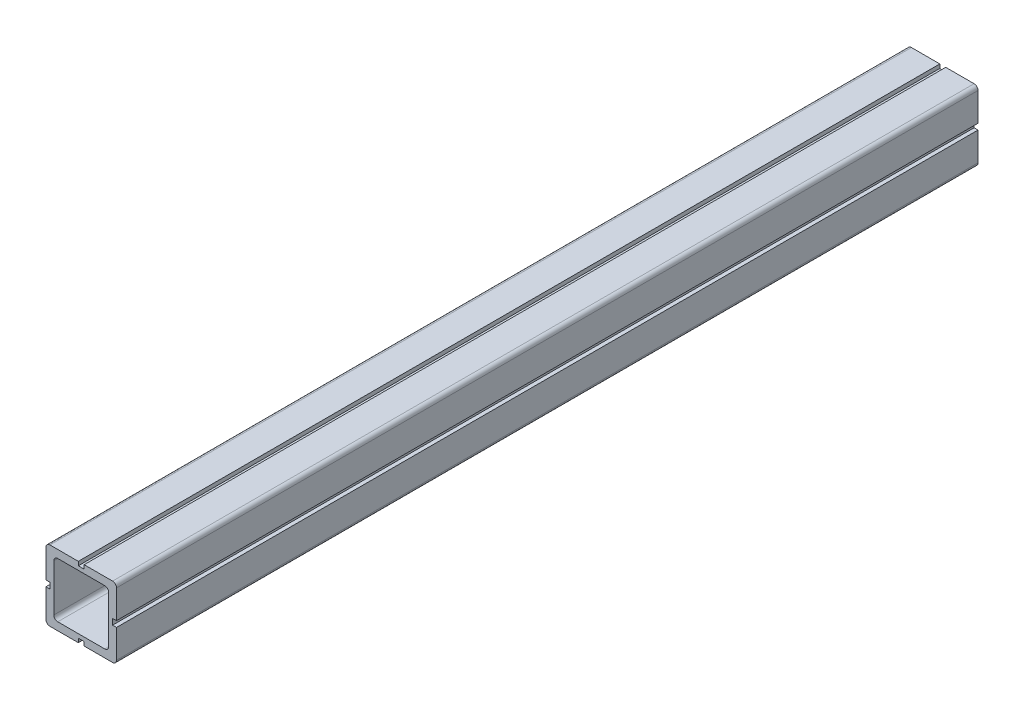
from build123d import *

# Parameters (mm, degrees)
SKETCH_1_W          = 18
SKETCH_1_H          = 18
SKETCH_1_W_2        = 14
SKETCH_1_H_2        = 14
EXTRUDE_1_DEPTH     = 110
FILLET_1_R          = 1
CUT_EXTRUDE_1_REACH = 222.368
SKETCH_2_W          = 1.5
SKETCH_2_H          = 2
SKETCH_2_W_2        = 2
SKETCH_2_H_2        = 1.5


with BuildPart() as part:
    # Sketch 1 → Extrude 1 (new, symmetric)
    with BuildSketch(Plane.XY):
        Rectangle(SKETCH_1_W, SKETCH_1_H)
        Rectangle(SKETCH_1_W_2, SKETCH_1_H_2, mode=Mode.SUBTRACT)
    extrude(amount=EXTRUDE_1_DEPTH, both=True)

    # Fillet 1
    fillet_1_edges = [part.edges().sort_by_distance(p)[0] for p in [
        (-7, 7, 0),
        (-7, -7, 0),
        (7, -7, 0),
        (7, 7, 0),
        (-9, 9, 0),
        (9, 9, 0),
        (9, -9, 0),
        (-9, -9, 0),
    ]]
    fillet(fillet_1_edges, radius=FILLET_1_R)

    # Sketch 2 → Cut-Extrude 1 (cut, up to next)
    with BuildSketch(Plane.XY.offset(110), mode=Mode.PRIVATE) as cut_extrude_1_sk1:
        with Locations((0, 9)):
            Rectangle(SKETCH_2_W, SKETCH_2_H)
    cut_extrude_1_tool1 = extrude(cut_extrude_1_sk1.sketch, amount=-CUT_EXTRUDE_1_REACH, mode=Mode.PRIVATE) & part.part
    # Sketch 2 → Cut-Extrude 1 (cut, up to next)
    with BuildSketch(Plane.XY.offset(110), mode=Mode.PRIVATE) as cut_extrude_1_sk2:
        with Locations((9, 0)):
            Rectangle(SKETCH_2_W_2, SKETCH_2_H_2)
    cut_extrude_1_tool2 = extrude(cut_extrude_1_sk2.sketch, amount=-CUT_EXTRUDE_1_REACH, mode=Mode.PRIVATE) & part.part
    # Sketch 2 → Cut-Extrude 1 (cut, up to next)
    with BuildSketch(Plane.XY.offset(110), mode=Mode.PRIVATE) as cut_extrude_1_sk3:
        with Locations((0, -9)):
            Rectangle(SKETCH_2_W, SKETCH_2_H)
    cut_extrude_1_tool3 = extrude(cut_extrude_1_sk3.sketch, amount=-CUT_EXTRUDE_1_REACH, mode=Mode.PRIVATE) & part.part
    # Sketch 2 → Cut-Extrude 1 (cut, up to next)
    with BuildSketch(Plane.XY.offset(110), mode=Mode.PRIVATE) as cut_extrude_1_sk4:
        with Locations((-9, 0)):
            Rectangle(SKETCH_2_W_2, SKETCH_2_H_2)
    cut_extrude_1_tool4 = extrude(cut_extrude_1_sk4.sketch, amount=-CUT_EXTRUDE_1_REACH, mode=Mode.PRIVATE) & part.part
    add(cut_extrude_1_tool1.solids().sort_by_distance((0, 9, 110))[0], mode=Mode.SUBTRACT)
    add(cut_extrude_1_tool2.solids().sort_by_distance((9, 0, 110))[0], mode=Mode.SUBTRACT)
    add(cut_extrude_1_tool3.solids().sort_by_distance((0, -9, 110))[0], mode=Mode.SUBTRACT)
    add(cut_extrude_1_tool4.solids().sort_by_distance((-9, 0, 110))[0], mode=Mode.SUBTRACT)


solid = part.part
